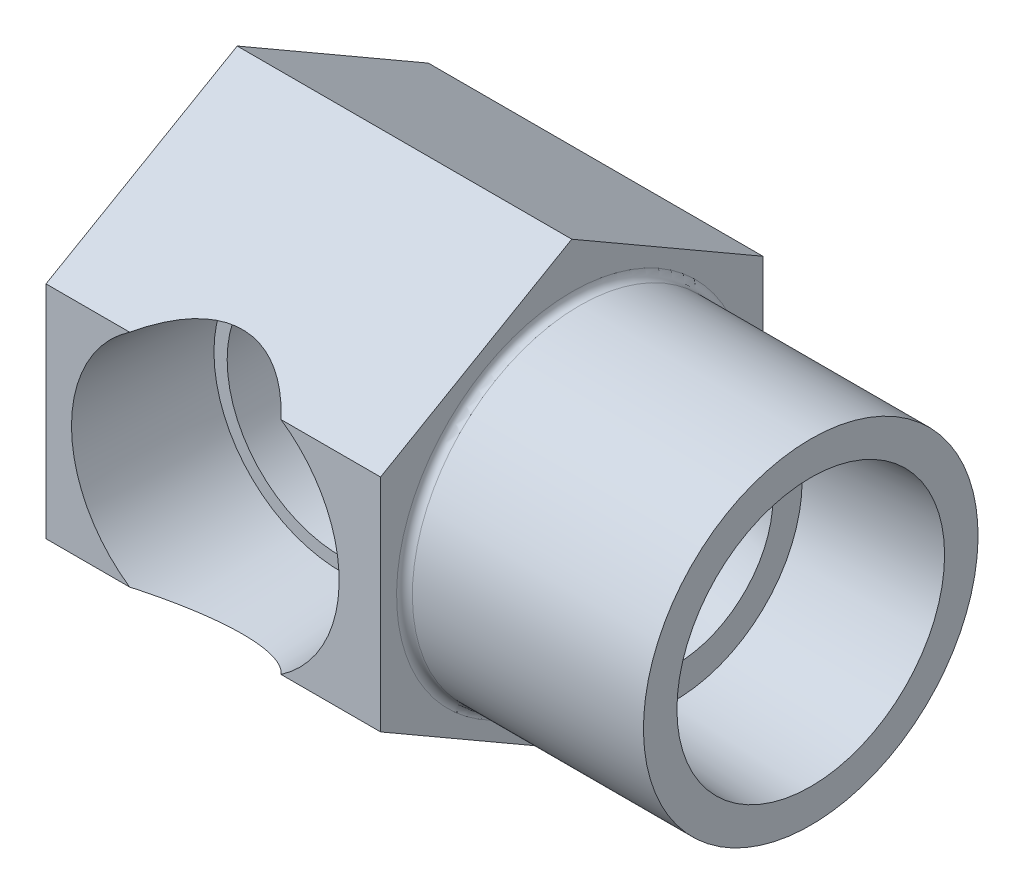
ISO-10303-21;
HEADER;
FILE_DESCRIPTION(('STEP AP214'),'2;1');
FILE_NAME('part.step','',(''),(''),'','','');
FILE_SCHEMA(('AUTOMOTIVE_DESIGN { 1 0 10303 214 1 1 1 1 }'));
ENDSEC;
DATA;
#1=APPLICATION_CONTEXT('core data for automotive mechanical design processes');
#2=APPLICATION_PROTOCOL_DEFINITION('international standard','automotive_design',2000,#1);
#3=PRODUCT_CONTEXT('',#1,'mechanical');
#4=PRODUCT('Part','Part','',(#3));
#5=PRODUCT_RELATED_PRODUCT_CATEGORY('part','',(#4));
#6=PRODUCT_DEFINITION_FORMATION('','',#4);
#7=PRODUCT_DEFINITION_CONTEXT('part definition',#1,'design');
#8=PRODUCT_DEFINITION('design','',#6,#7);
#9=PRODUCT_DEFINITION_SHAPE('','',#8);
#10=(LENGTH_UNIT() NAMED_UNIT(*) SI_UNIT(.MILLI.,.METRE.));
#11=(NAMED_UNIT(*) PLANE_ANGLE_UNIT() SI_UNIT($,.RADIAN.));
#12=(NAMED_UNIT(*) SI_UNIT($,.STERADIAN.) SOLID_ANGLE_UNIT());
#13=UNCERTAINTY_MEASURE_WITH_UNIT(LENGTH_MEASURE(1.E-05),#10,'distance_accuracy_value','');
#14=(GEOMETRIC_REPRESENTATION_CONTEXT(3) GLOBAL_UNCERTAINTY_ASSIGNED_CONTEXT((#13)) GLOBAL_UNIT_ASSIGNED_CONTEXT((#10,
#11,#12)) REPRESENTATION_CONTEXT('',''));
#15=CARTESIAN_POINT('',(0.,0.,0.));
#16=DIRECTION('',(0.,0.,1.));
#17=DIRECTION('',(1.,0.,0.));
#18=AXIS2_PLACEMENT_3D('',#15,#16,#17);
#19=CARTESIAN_POINT('',(0.,0.,5.51642065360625E-13));
#20=DIRECTION('',(-1.,0.,0.));
#21=DIRECTION('',(0.,0.,1.));
#22=AXIS2_PLACEMENT_3D('',#19,#20,#21);
#23=PLANE('',#22);
#24=CARTESIAN_POINT('',(0.,0.,5.51642065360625E-13));
#25=DIRECTION('',(-1.,0.,0.));
#26=DIRECTION('',(0.,1.,0.));
#27=AXIS2_PLACEMENT_3D('',#24,#25,#26);
#28=CIRCLE('',#27,16.66875);
#29=CARTESIAN_POINT('',(0.,16.66875,5.51642065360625E-13));
#30=VERTEX_POINT('',#29);
#31=EDGE_CURVE('E282',#30,#30,#28,.T.);
#32=ORIENTED_EDGE('',*,*,#31,.F.);
#33=EDGE_LOOP('',(#32));
#34=FACE_BOUND('',#33,.T.);
#35=CARTESIAN_POINT('',(0.,0.,5.51642065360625E-13));
#36=DIRECTION('',(-1.,0.,0.));
#37=DIRECTION('',(0.,0.,1.));
#38=AXIS2_PLACEMENT_3D('',#35,#36,#37);
#39=CIRCLE('',#38,13.335);
#40=CARTESIAN_POINT('',(0.,0.,13.3350000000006));
#41=VERTEX_POINT('',#40);
#42=EDGE_CURVE('E324',#41,#41,#39,.T.);
#43=ORIENTED_EDGE('',*,*,#42,.T.);
#44=EDGE_LOOP('',(#43));
#45=FACE_BOUND('',#44,.T.);
#46=ADVANCED_FACE('F15',(#34,#45),#23,.F.);
#47=CARTESIAN_POINT('',(-23.8125,10.9985226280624,19.05));
#48=DIRECTION('',(0.,0.,-1.));
#49=DIRECTION('',(0.,1.,0.));
#50=AXIS2_PLACEMENT_3D('',#47,#48,#49);
#51=PLANE('',#50);
#52=CARTESIAN_POINT('',(-41.275,0.,19.05));
#53=DIRECTION('',(0.,0.,-1.));
#54=DIRECTION('',(-1.,0.,0.));
#55=AXIS2_PLACEMENT_3D('',#52,#53,#54);
#56=CIRCLE('',#55,13.335);
#57=CARTESIAN_POINT('',(-33.734792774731,10.9985226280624,19.05));
#58=VERTEX_POINT('',#57);
#59=CARTESIAN_POINT('',(-33.7347927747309,-10.9985226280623,19.05));
#60=VERTEX_POINT('',#59);
#61=EDGE_CURVE('E334',#58,#60,#56,.T.);
#62=ORIENTED_EDGE('',*,*,#61,.T.);
#63=DIRECTION('',(-1.,0.,0.));
#64=VECTOR('',#63,1.);
#65=CARTESIAN_POINT('',(-23.8125,-10.9985226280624,19.05));
#66=LINE('',#65,#64);
#67=CARTESIAN_POINT('',(-23.8125,-10.9985226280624,19.05));
#68=VERTEX_POINT('',#67);
#69=EDGE_CURVE('E298',#68,#60,#66,.T.);
#70=ORIENTED_EDGE('',*,*,#69,.F.);
#71=DIRECTION('',(0.,-1.,0.));
#72=VECTOR('',#71,1.);
#73=CARTESIAN_POINT('',(-23.8125,10.9985226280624,19.05));
#74=LINE('',#73,#72);
#75=CARTESIAN_POINT('',(-23.8125,10.9985226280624,19.05));
#76=VERTEX_POINT('',#75);
#77=EDGE_CURVE('E288',#76,#68,#74,.T.);
#78=ORIENTED_EDGE('',*,*,#77,.F.);
#79=DIRECTION('',(-1.,0.,0.));
#80=VECTOR('',#79,1.);
#81=CARTESIAN_POINT('',(-23.8125,10.9985226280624,19.05));
#82=LINE('',#81,#80);
#83=EDGE_CURVE('E302',#76,#58,#82,.T.);
#84=ORIENTED_EDGE('',*,*,#83,.T.);
#85=EDGE_LOOP('',(#62,#70,#78,#84));
#86=FACE_BOUND('',#85,.T.);
#87=ADVANCED_FACE('F192',(#86),#51,.F.);
#88=CARTESIAN_POINT('',(-23.8125,-21.9970452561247,0.));
#89=DIRECTION('',(0.,0.866025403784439,0.5));
#90=DIRECTION('',(0.,-0.5,0.866025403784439));
#91=AXIS2_PLACEMENT_3D('',#88,#89,#90);
#92=PLANE('',#91);
#93=DIRECTION('',(0.,0.5,-0.866025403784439));
#94=VECTOR('',#93,1.);
#95=CARTESIAN_POINT('',(-57.15,-21.9970452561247,0.));
#96=LINE('',#95,#94);
#97=CARTESIAN_POINT('',(-57.15,-21.9970452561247,0.));
#98=VERTEX_POINT('',#97);
#99=CARTESIAN_POINT('',(-57.15,-10.9985226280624,-19.05));
#100=VERTEX_POINT('',#99);
#101=EDGE_CURVE('E253',#98,#100,#96,.T.);
#102=ORIENTED_EDGE('',*,*,#101,.T.);
#103=DIRECTION('',(-1.,0.,0.));
#104=VECTOR('',#103,1.);
#105=CARTESIAN_POINT('',(-23.8125,-10.9985226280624,-19.05));
#106=LINE('',#105,#104);
#107=CARTESIAN_POINT('',(-23.8125,-10.9985226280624,-19.05));
#108=VERTEX_POINT('',#107);
#109=EDGE_CURVE('E247',#108,#100,#106,.T.);
#110=ORIENTED_EDGE('',*,*,#109,.F.);
#111=DIRECTION('',(0.,0.5,-0.866025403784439));
#112=VECTOR('',#111,1.);
#113=CARTESIAN_POINT('',(-23.8125,-21.9970452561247,0.));
#114=LINE('',#113,#112);
#115=CARTESIAN_POINT('',(-23.8125,-21.9970452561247,0.));
#116=VERTEX_POINT('',#115);
#117=EDGE_CURVE('E279',#116,#108,#114,.T.);
#118=ORIENTED_EDGE('',*,*,#117,.F.);
#119=DIRECTION('',(-1.,0.,0.));
#120=VECTOR('',#119,1.);
#121=CARTESIAN_POINT('',(-23.8125,-21.9970452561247,0.));
#122=LINE('',#121,#120);
#123=EDGE_CURVE('E292',#116,#98,#122,.T.);
#124=ORIENTED_EDGE('',*,*,#123,.T.);
#125=EDGE_LOOP('',(#102,#110,#118,#124));
#126=FACE_BOUND('',#125,.T.);
#127=ADVANCED_FACE('F17',(#126),#92,.F.);
#128=CARTESIAN_POINT('',(-23.8125,-10.9985226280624,-19.05));
#129=DIRECTION('',(0.,0.,1.));
#130=DIRECTION('',(1.,0.,0.));
#131=AXIS2_PLACEMENT_3D('',#128,#129,#130);
#132=PLANE('',#131);
#133=DIRECTION('',(0.,1.,0.));
#134=VECTOR('',#133,1.);
#135=CARTESIAN_POINT('',(-57.15,-10.9985226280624,-19.05));
#136=LINE('',#135,#134);
#137=CARTESIAN_POINT('',(-57.15,10.9985226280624,-19.05));
#138=VERTEX_POINT('',#137);
#139=EDGE_CURVE('E242',#100,#138,#136,.T.);
#140=ORIENTED_EDGE('',*,*,#139,.T.);
#141=DIRECTION('',(-1.,0.,0.));
#142=VECTOR('',#141,1.);
#143=CARTESIAN_POINT('',(-23.8125,10.9985226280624,-19.05));
#144=LINE('',#143,#142);
#145=CARTESIAN_POINT('',(-23.8125,10.9985226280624,-19.05));
#146=VERTEX_POINT('',#145);
#147=EDGE_CURVE('E244',#146,#138,#144,.T.);
#148=ORIENTED_EDGE('',*,*,#147,.F.);
#149=DIRECTION('',(0.,1.,0.));
#150=VECTOR('',#149,1.);
#151=CARTESIAN_POINT('',(-23.8125,-10.9985226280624,-19.05));
#152=LINE('',#151,#150);
#153=EDGE_CURVE('E283',#108,#146,#152,.T.);
#154=ORIENTED_EDGE('',*,*,#153,.F.);
#155=ORIENTED_EDGE('',*,*,#109,.T.);
#156=EDGE_LOOP('',(#140,#148,#154,#155));
#157=FACE_BOUND('',#156,.T.);
#158=ADVANCED_FACE('F231',(#157),#132,.F.);
#159=CARTESIAN_POINT('',(-23.8125,10.9985226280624,-19.05));
#160=DIRECTION('',(0.,-0.866025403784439,0.5));
#161=DIRECTION('',(0.,-0.5,-0.866025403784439));
#162=AXIS2_PLACEMENT_3D('',#159,#160,#161);
#163=PLANE('',#162);
#164=DIRECTION('',(0.,0.5,0.866025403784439));
#165=VECTOR('',#164,1.);
#166=CARTESIAN_POINT('',(-57.15,10.9985226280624,-19.05));
#167=LINE('',#166,#165);
#168=CARTESIAN_POINT('',(-57.15,21.9970452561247,0.));
#169=VERTEX_POINT('',#168);
#170=EDGE_CURVE('E252',#138,#169,#167,.T.);
#171=ORIENTED_EDGE('',*,*,#170,.T.);
#172=DIRECTION('',(-1.,0.,0.));
#173=VECTOR('',#172,1.);
#174=CARTESIAN_POINT('',(-23.8125,21.9970452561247,0.));
#175=LINE('',#174,#173);
#176=CARTESIAN_POINT('',(-23.8125,21.9970452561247,0.));
#177=VERTEX_POINT('',#176);
#178=EDGE_CURVE('E258',#177,#169,#175,.T.);
#179=ORIENTED_EDGE('',*,*,#178,.F.);
#180=DIRECTION('',(0.,0.5,0.866025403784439));
#181=VECTOR('',#180,1.);
#182=CARTESIAN_POINT('',(-23.8125,10.9985226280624,-19.05));
#183=LINE('',#182,#181);
#184=EDGE_CURVE('E257',#146,#177,#183,.T.);
#185=ORIENTED_EDGE('',*,*,#184,.F.);
#186=ORIENTED_EDGE('',*,*,#147,.T.);
#187=EDGE_LOOP('',(#171,#179,#185,#186));
#188=FACE_BOUND('',#187,.T.);
#189=ADVANCED_FACE('F228',(#188),#163,.F.);
#190=CARTESIAN_POINT('',(-23.8125,21.9970452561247,0.));
#191=DIRECTION('',(0.,-0.866025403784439,-0.5));
#192=DIRECTION('',(0.,0.5,-0.866025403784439));
#193=AXIS2_PLACEMENT_3D('',#190,#191,#192);
#194=PLANE('',#193);
#195=CARTESIAN_POINT('',(-48.815207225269,10.9985226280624,19.05));
#196=VERTEX_POINT('',#195);
#197=CARTESIAN_POINT('',(-57.15,10.9985226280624,19.05));
#198=VERTEX_POINT('',#197);
#199=EDGE_CURVE('E301',#196,#198,#82,.T.);
#200=ORIENTED_EDGE('',*,*,#199,.F.);
#201=CARTESIAN_POINT('',(-41.275,-1.31189154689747,40.3722628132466));
#202=DIRECTION('',(0.,-0.866025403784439,-0.5));
#203=DIRECTION('',(0.,-0.5,0.866025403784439));
#204=AXIS2_PLACEMENT_3D('',#201,#202,#203);
#205=ELLIPSE('',#204,28.9049048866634,14.3927871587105);
#206=EDGE_CURVE('E336',#196,#58,#205,.T.);
#207=ORIENTED_EDGE('',*,*,#206,.T.);
#208=ORIENTED_EDGE('',*,*,#83,.F.);
#209=DIRECTION('',(0.,-0.5,0.866025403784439));
#210=VECTOR('',#209,1.);
#211=CARTESIAN_POINT('',(-23.8125,21.9970452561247,0.));
#212=LINE('',#211,#210);
#213=EDGE_CURVE('E286',#177,#76,#212,.T.);
#214=ORIENTED_EDGE('',*,*,#213,.F.);
#215=ORIENTED_EDGE('',*,*,#178,.T.);
#216=DIRECTION('',(0.,-0.5,0.866025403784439));
#217=VECTOR('',#216,1.);
#218=CARTESIAN_POINT('',(-57.15,21.9970452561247,0.));
#219=LINE('',#218,#217);
#220=EDGE_CURVE('E263',#169,#198,#219,.T.);
#221=ORIENTED_EDGE('',*,*,#220,.T.);
#222=EDGE_LOOP('',(#200,#207,#208,#214,#215,#221));
#223=FACE_BOUND('',#222,.T.);
#224=ADVANCED_FACE('F224',(#223),#194,.F.);
#225=CARTESIAN_POINT('',(-48.8152072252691,-10.9985226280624,19.05));
#226=VERTEX_POINT('',#225);
#227=CARTESIAN_POINT('',(-57.15,-10.9985226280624,19.05));
#228=VERTEX_POINT('',#227);
#229=EDGE_CURVE('E297',#226,#228,#66,.T.);
#230=ORIENTED_EDGE('',*,*,#229,.F.);
#231=EDGE_CURVE('E43',#226,#196,#56,.T.);
#232=ORIENTED_EDGE('',*,*,#231,.T.);
#233=ORIENTED_EDGE('',*,*,#199,.T.);
#234=DIRECTION('',(0.,-1.,0.));
#235=VECTOR('',#234,1.);
#236=CARTESIAN_POINT('',(-57.15,10.9985226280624,19.05));
#237=LINE('',#236,#235);
#238=EDGE_CURVE('E269',#198,#228,#237,.T.);
#239=ORIENTED_EDGE('',*,*,#238,.T.);
#240=EDGE_LOOP('',(#230,#232,#233,#239));
#241=FACE_BOUND('',#240,.T.);
#242=ADVANCED_FACE('F201',(#241),#51,.F.);
#243=CARTESIAN_POINT('',(-23.8125,-10.9985226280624,19.05));
#244=DIRECTION('',(0.,0.866025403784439,-0.5));
#245=DIRECTION('',(0.,0.5,0.866025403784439));
#246=AXIS2_PLACEMENT_3D('',#243,#244,#245);
#247=PLANE('',#246);
#248=ORIENTED_EDGE('',*,*,#69,.T.);
#249=CARTESIAN_POINT('',(-41.275,1.31189154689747,40.3722628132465));
#250=DIRECTION('',(0.,0.866025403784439,-0.5));
#251=DIRECTION('',(0.,0.5,0.866025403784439));
#252=AXIS2_PLACEMENT_3D('',#249,#250,#251);
#253=ELLIPSE('',#252,28.9049048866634,14.3927871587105);
#254=EDGE_CURVE('E313',#60,#226,#253,.T.);
#255=ORIENTED_EDGE('',*,*,#254,.T.);
#256=ORIENTED_EDGE('',*,*,#229,.T.);
#257=DIRECTION('',(0.,-0.5,-0.866025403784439));
#258=VECTOR('',#257,1.);
#259=CARTESIAN_POINT('',(-57.15,-10.9985226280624,19.05));
#260=LINE('',#259,#258);
#261=EDGE_CURVE('E276',#228,#98,#260,.T.);
#262=ORIENTED_EDGE('',*,*,#261,.T.);
#263=ORIENTED_EDGE('',*,*,#123,.F.);
#264=DIRECTION('',(0.,-0.5,-0.866025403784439));
#265=VECTOR('',#264,1.);
#266=CARTESIAN_POINT('',(-23.8125,-10.9985226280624,19.05));
#267=LINE('',#266,#265);
#268=EDGE_CURVE('E290',#68,#116,#267,.T.);
#269=ORIENTED_EDGE('',*,*,#268,.F.);
#270=EDGE_LOOP('',(#248,#255,#256,#262,#263,#269));
#271=FACE_BOUND('',#270,.T.);
#272=ADVANCED_FACE('F218',(#271),#247,.F.);
#273=CARTESIAN_POINT('',(-23.8125,-10.9985226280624,-19.05));
#274=DIRECTION('',(1.,0.,0.));
#275=DIRECTION('',(0.,1.,0.));
#276=AXIS2_PLACEMENT_3D('',#273,#274,#275);
#277=PLANE('',#276);
#278=CARTESIAN_POINT('',(-23.8125,0.,5.51642065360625E-13));
#279=DIRECTION('',(1.,0.,0.));
#280=DIRECTION('',(0.,1.,0.));
#281=AXIS2_PLACEMENT_3D('',#278,#279,#280);
#282=CIRCLE('',#281,17.45615);
#283=CARTESIAN_POINT('',(-23.8125,17.45615,5.51642065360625E-13));
#284=VERTEX_POINT('',#283);
#285=EDGE_CURVE('E310',#284,#284,#282,.F.);
#286=ORIENTED_EDGE('',*,*,#285,.T.);
#287=EDGE_LOOP('',(#286));
#288=FACE_BOUND('',#287,.T.);
#289=ORIENTED_EDGE('',*,*,#117,.T.);
#290=ORIENTED_EDGE('',*,*,#153,.T.);
#291=ORIENTED_EDGE('',*,*,#184,.T.);
#292=ORIENTED_EDGE('',*,*,#213,.T.);
#293=ORIENTED_EDGE('',*,*,#77,.T.);
#294=ORIENTED_EDGE('',*,*,#268,.T.);
#295=EDGE_LOOP('',(#289,#290,#291,#292,#293,#294));
#296=FACE_BOUND('',#295,.T.);
#297=ADVANCED_FACE('F214',(#288,#296),#277,.T.);
#298=CARTESIAN_POINT('',(-57.15,-10.9985226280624,-19.05));
#299=DIRECTION('',(1.,0.,0.));
#300=DIRECTION('',(0.,1.,0.));
#301=AXIS2_PLACEMENT_3D('',#298,#299,#300);
#302=PLANE('',#301);
#303=ORIENTED_EDGE('',*,*,#101,.F.);
#304=ORIENTED_EDGE('',*,*,#261,.F.);
#305=ORIENTED_EDGE('',*,*,#238,.F.);
#306=ORIENTED_EDGE('',*,*,#220,.F.);
#307=ORIENTED_EDGE('',*,*,#170,.F.);
#308=ORIENTED_EDGE('',*,*,#139,.F.);
#309=EDGE_LOOP('',(#303,#304,#305,#306,#307,#308));
#310=FACE_BOUND('',#309,.T.);
#311=ADVANCED_FACE('F210',(#310),#302,.F.);
#312=CARTESIAN_POINT('',(0.,0.,5.51642065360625E-13));
#313=DIRECTION('',(-1.,0.,0.));
#314=DIRECTION('',(0.,0.,1.));
#315=AXIS2_PLACEMENT_3D('',#312,#313,#314);
#316=CYLINDRICAL_SURFACE('',#315,16.66875);
#317=CARTESIAN_POINT('',(-23.0251,0.,5.51642065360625E-13));
#318=DIRECTION('',(1.,0.,0.));
#319=DIRECTION('',(0.,1.,0.));
#320=AXIS2_PLACEMENT_3D('',#317,#318,#319);
#321=CIRCLE('',#320,16.66875);
#322=CARTESIAN_POINT('',(-23.0251,16.66875,5.51642065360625E-13));
#323=VERTEX_POINT('',#322);
#324=EDGE_CURVE('E307',#323,#323,#321,.T.);
#325=ORIENTED_EDGE('',*,*,#324,.T.);
#326=EDGE_LOOP('',(#325));
#327=FACE_BOUND('',#326,.T.);
#328=ORIENTED_EDGE('',*,*,#31,.T.);
#329=EDGE_LOOP('',(#328));
#330=FACE_BOUND('',#329,.T.);
#331=ADVANCED_FACE('F207',(#327,#330),#316,.T.);
#332=CARTESIAN_POINT('',(-23.0251,0.,5.51642065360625E-13));
#333=DIRECTION('',(1.,0.,0.));
#334=DIRECTION('',(0.,1.,0.));
#335=AXIS2_PLACEMENT_3D('',#332,#333,#334);
#336=TOROIDAL_SURFACE('',#335,17.45615,0.7874);
#337=ORIENTED_EDGE('',*,*,#285,.F.);
#338=EDGE_LOOP('',(#337));
#339=FACE_BOUND('',#338,.T.);
#340=ORIENTED_EDGE('',*,*,#324,.F.);
#341=EDGE_LOOP('',(#340));
#342=FACE_BOUND('',#341,.T.);
#343=ADVANCED_FACE('F206',(#339,#342),#336,.F.);
#344=CARTESIAN_POINT('',(-41.275,0.,5.5626));
#345=DIRECTION('',(0.,0.,1.));
#346=DIRECTION('',(1.,0.,0.));
#347=AXIS2_PLACEMENT_3D('',#344,#345,#346);
#348=CONICAL_SURFACE('',#347,12.6281553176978,0.0523598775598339);
#349=ORIENTED_EDGE('',*,*,#254,.F.);
#350=ORIENTED_EDGE('',*,*,#61,.F.);
#351=ORIENTED_EDGE('',*,*,#206,.F.);
#352=ORIENTED_EDGE('',*,*,#231,.F.);
#353=EDGE_LOOP('',(#349,#350,#351,#352));
#354=FACE_BOUND('',#353,.T.);
#355=CARTESIAN_POINT('',(-41.275,0.,5.5626));
#356=DIRECTION('',(0.,0.,-1.));
#357=DIRECTION('',(-1.,0.,0.));
#358=AXIS2_PLACEMENT_3D('',#355,#356,#357);
#359=CIRCLE('',#358,12.6281553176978);
#360=CARTESIAN_POINT('',(-29.8180676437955,-5.31121527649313,5.5626));
#361=VERTEX_POINT('',#360);
#362=CARTESIAN_POINT('',(-29.8180676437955,5.31121527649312,5.5626));
#363=VERTEX_POINT('',#362);
#364=EDGE_CURVE('E323',#361,#363,#359,.T.);
#365=ORIENTED_EDGE('',*,*,#364,.T.);
#366=CARTESIAN_POINT('',(-29.8182058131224,5.31148839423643,5.5624));
#367=CARTESIAN_POINT('',(-29.7305378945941,5.13821159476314,5.68929346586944));
#368=CARTESIAN_POINT('',(-29.6457157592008,4.95980580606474,5.81130883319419));
#369=CARTESIAN_POINT('',(-29.4828249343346,4.59278409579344,6.04447340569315));
#370=CARTESIAN_POINT('',(-29.4047638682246,4.40415702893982,6.15561036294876));
#371=CARTESIAN_POINT('',(-29.2560137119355,4.01544544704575,6.36653280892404));
#372=CARTESIAN_POINT('',(-29.1853945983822,3.815275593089,6.46621123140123));
#373=CARTESIAN_POINT('',(-29.0535892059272,3.40564401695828,6.65164048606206));
#374=CARTESIAN_POINT('',(-28.9923999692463,3.19618523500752,6.73739568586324));
#375=CARTESIAN_POINT('',(-28.8802782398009,2.76729953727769,6.89412911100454));
#376=CARTESIAN_POINT('',(-28.8294225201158,2.5478118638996,6.96499685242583));
#377=CARTESIAN_POINT('',(-28.739727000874,2.10161531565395,7.08975358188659));
#378=CARTESIAN_POINT('',(-28.7008881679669,1.87490586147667,7.14364120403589));
#379=CARTESIAN_POINT('',(-28.6364007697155,1.41703547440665,7.23300779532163));
#380=CARTESIAN_POINT('',(-28.6106971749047,1.18589739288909,7.26856357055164));
#381=CARTESIAN_POINT('',(-28.572976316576,0.720397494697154,7.32071441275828));
#382=CARTESIAN_POINT('',(-28.5609567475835,0.486036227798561,7.33731267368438));
#383=CARTESIAN_POINT('',(-28.5515645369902,0.0451331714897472,7.35028343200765));
#384=CARTESIAN_POINT('',(-28.5525834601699,-0.161313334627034,7.34887698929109));
#385=CARTESIAN_POINT('',(-28.5654098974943,-0.573216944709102,7.3311615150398));
#386=CARTESIAN_POINT('',(-28.5772165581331,-0.778674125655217,7.3148536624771));
#387=CARTESIAN_POINT('',(-28.6113629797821,-1.18722198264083,7.26764125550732));
#388=CARTESIAN_POINT('',(-28.6337135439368,-1.39031001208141,7.23672173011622));
#389=CARTESIAN_POINT('',(-28.6884550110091,-1.79246165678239,7.16087865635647));
#390=CARTESIAN_POINT('',(-28.7208459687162,-1.99152525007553,7.11595503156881));
#391=CARTESIAN_POINT('',(-28.7935819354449,-2.37687164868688,7.0148737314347));
#392=CARTESIAN_POINT('',(-28.8335745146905,-2.56335188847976,6.95921260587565));
#393=CARTESIAN_POINT('',(-28.9215345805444,-2.93061912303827,6.83649696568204));
#394=CARTESIAN_POINT('',(-28.9695051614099,-3.1114038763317,6.76943803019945));
#395=CARTESIAN_POINT('',(-29.124263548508,-3.6440648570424,6.55247683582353));
#396=CARTESIAN_POINT('',(-29.2419525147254,-3.9865276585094,6.38671489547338));
#397=CARTESIAN_POINT('',(-29.4397249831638,-4.48908250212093,6.10583790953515));
#398=CARTESIAN_POINT('',(-29.5117257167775,-4.65969641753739,6.00318971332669));
#399=CARTESIAN_POINT('',(-29.6611034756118,-4.99206370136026,5.78916867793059));
#400=CARTESIAN_POINT('',(-29.7384630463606,-5.15384302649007,5.67782402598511));
#401=CARTESIAN_POINT('',(-29.8182058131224,-5.31148839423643,5.5624));
#402=B_SPLINE_CURVE_WITH_KNOTS('',3,(#366,#367,#368,#369,#370,#371,#372,#373,#374,#375,#376,
#377,#378,#379,#380,#381,#382,#383,#384,#385,#386,#387,#388,#389,#390,#391,#392,#393,#394,#395,
#396,#397,#398,#399,#400,#401),.UNSPECIFIED.,.F.,.F.,(4,2,2,2,2,2,2,2,2,2,2,2,2,2,2,2,2,4),(0.,
0.695930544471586,1.39263583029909,2.09539702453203,2.79793733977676,3.50552033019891,
4.21316022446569,4.91781067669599,5.62234239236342,6.24089661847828,6.85940190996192,
7.47854229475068,8.09768605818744,8.69310026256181,9.28874593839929,10.4791609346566,
11.1140169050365,11.7468943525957),.UNSPECIFIED.);
#403=EDGE_CURVE('E131',#363,#361,#402,.T.);
#404=ORIENTED_EDGE('',*,*,#403,.T.);
#405=EDGE_LOOP('',(#365,#404));
#406=FACE_BOUND('',#405,.T.);
#407=ADVANCED_FACE('F351',(#354,#406),#348,.F.);
#408=CARTESIAN_POINT('',(-41.275,0.,-11.0607852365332));
#409=DIRECTION('',(0.,0.,1.));
#410=DIRECTION('',(1.,0.,0.));
#411=AXIS2_PLACEMENT_3D('',#408,#409,#410);
#412=CONICAL_SURFACE('',#411,0.,1.04719755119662);
#413=CARTESIAN_POINT('',(-41.275,0.,-4.53044908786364));
#414=DIRECTION('',(0.,0.,-1.));
#415=DIRECTION('',(-1.,0.,0.));
#416=AXIS2_PLACEMENT_3D('',#413,#414,#415);
#417=CIRCLE('',#416,11.310874);
#418=CARTESIAN_POINT('',(-35.7325391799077,-9.85986808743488,-4.53044908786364));
#419=VERTEX_POINT('',#418);
#420=CARTESIAN_POINT('',(-35.7325391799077,9.85986808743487,-4.53044908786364));
#421=VERTEX_POINT('',#420);
#422=EDGE_CURVE('E130',#419,#421,#417,.T.);
#423=ORIENTED_EDGE('',*,*,#422,.F.);
#424=CARTESIAN_POINT('',(-35.7318247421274,-9.85986385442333,-4.53024908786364));
#425=CARTESIAN_POINT('',(-36.0509366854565,-9.86173387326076,-4.61958553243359));
#426=CARTESIAN_POINT('',(-36.3717124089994,-9.86390668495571,-4.70330076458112));
#427=CARTESIAN_POINT('',(-37.0157137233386,-9.86925092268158,-4.85708254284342));
#428=CARTESIAN_POINT('',(-37.338931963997,-9.87242003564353,-4.92718010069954));
#429=CARTESIAN_POINT('',(-37.9885492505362,-9.88015648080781,-5.05177867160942));
#430=CARTESIAN_POINT('',(-38.3149495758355,-9.88472439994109,-5.10627311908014));
#431=CARTESIAN_POINT('',(-38.806727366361,-9.89271020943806,-5.17485095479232));
#432=CARTESIAN_POINT('',(-38.971211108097,-9.8955651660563,-5.1955328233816));
#433=CARTESIAN_POINT('',(-39.3006993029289,-9.9016266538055,-5.23229495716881));
#434=CARTESIAN_POINT('',(-39.4657038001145,-9.90483321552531,-5.24837482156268));
#435=CARTESIAN_POINT('',(-39.6309149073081,-9.9082022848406,-5.2620644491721));
#436=B_SPLINE_CURVE_WITH_KNOTS('',3,(#424,#425,#426,#427,#428,#429,#430,#431,#432,#433,#434,
#435),.UNSPECIFIED.,.F.,.F.,(4,2,2,2,2,4),(0.,0.994235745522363,1.98618005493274,
2.97854115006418,3.47589411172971,3.9732903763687),.UNSPECIFIED.);
#437=CARTESIAN_POINT('',(-37.8107767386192,-9.87808537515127,-5.01712703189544));
#438=VERTEX_POINT('',#437);
#439=EDGE_CURVE('E122',#419,#438,#436,.T.);
#440=ORIENTED_EDGE('',*,*,#439,.T.);
#441=CARTESIAN_POINT('',(-44.0118236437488,0.,-9.48067936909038));
#442=CARTESIAN_POINT('',(-44.0118239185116,-0.0348789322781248,-9.48067956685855));
#443=CARTESIAN_POINT('',(-44.0115269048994,-0.0697578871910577,-9.48046577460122));
#444=CARTESIAN_POINT('',(-44.0102131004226,-0.146963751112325,-9.47952008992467));
#445=CARTESIAN_POINT('',(-44.0090558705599,-0.189287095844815,-9.47868710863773));
#446=CARTESIAN_POINT('',(-44.0058188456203,-0.275269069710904,-9.47635707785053));
#447=CARTESIAN_POINT('',(-44.0037100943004,-0.318926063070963,-9.47483918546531));
#448=CARTESIAN_POINT('',(-43.9998070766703,-0.385188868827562,-9.4720297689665));
#449=CARTESIAN_POINT('',(-43.9983489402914,-0.407825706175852,-9.47098019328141));
#450=CARTESIAN_POINT('',(-43.9936029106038,-0.475712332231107,-9.46756397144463));
#451=CARTESIAN_POINT('',(-43.9899440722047,-0.520924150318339,-9.4649303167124));
#452=CARTESIAN_POINT('',(-43.9816517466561,-0.611218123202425,-9.45896144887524));
#453=CARTESIAN_POINT('',(-43.977018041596,-0.656300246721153,-9.45562607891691));
#454=CARTESIAN_POINT('',(-43.9513258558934,-0.882330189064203,-9.43713268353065));
#455=CARTESIAN_POINT('',(-43.9229530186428,-1.06210426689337,-9.41670974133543));
#456=CARTESIAN_POINT('',(-43.8521480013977,-1.41729567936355,-9.36574384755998));
#457=CARTESIAN_POINT('',(-43.8097136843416,-1.59271234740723,-9.33519935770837));
#458=CARTESIAN_POINT('',(-43.6992708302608,-1.98604730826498,-9.25570189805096));
#459=CARTESIAN_POINT('',(-43.6274361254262,-2.20232946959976,-9.20399482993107));
#460=CARTESIAN_POINT('',(-43.467836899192,-2.6259043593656,-9.08911430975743));
#461=CARTESIAN_POINT('',(-43.3800549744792,-2.83318695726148,-9.02592833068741));
#462=CARTESIAN_POINT('',(-43.2384371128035,-3.13876850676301,-8.92399090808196));
#463=CARTESIAN_POINT('',(-43.189219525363,-3.24038317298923,-8.88856378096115));
#464=CARTESIAN_POINT('',(-43.0879473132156,-3.44144938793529,-8.81566740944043));
#465=CARTESIAN_POINT('',(-43.0358926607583,-3.54090091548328,-8.77819814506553));
#466=CARTESIAN_POINT('',(-42.9293169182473,-3.73767848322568,-8.70148425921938));
#467=CARTESIAN_POINT('',(-42.8747974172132,-3.83500583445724,-8.66224078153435));
#468=CARTESIAN_POINT('',(-42.7635488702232,-4.02771448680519,-8.58216338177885));
#469=CARTESIAN_POINT('',(-42.7068198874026,-4.12309584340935,-8.54132950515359));
#470=CARTESIAN_POINT('',(-42.5278083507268,-4.41615514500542,-8.41247588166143));
#471=CARTESIAN_POINT('',(-42.4021757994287,-4.61073581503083,-8.32204478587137));
#472=CARTESIAN_POINT('',(-42.1441247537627,-4.99297318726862,-8.13629802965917));
#473=CARTESIAN_POINT('',(-42.0117042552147,-5.18062781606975,-8.04098092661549));
#474=CARTESIAN_POINT('',(-41.7413336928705,-5.55013685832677,-7.84636650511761));
#475=CARTESIAN_POINT('',(-41.6033777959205,-5.73198477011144,-7.74706498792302));
#476=CARTESIAN_POINT('',(-41.3231302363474,-6.09048124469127,-7.54534104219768));
#477=CARTESIAN_POINT('',(-41.1808389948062,-6.26713030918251,-7.44291891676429));
#478=CARTESIAN_POINT('',(-40.891870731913,-6.61695729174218,-7.23491775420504));
#479=CARTESIAN_POINT('',(-40.745173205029,-6.79010942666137,-7.12932395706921));
#480=CARTESIAN_POINT('',(-40.4487972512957,-7.13249479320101,-6.91599069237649));
#481=CARTESIAN_POINT('',(-40.299118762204,-7.30172794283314,-6.80825118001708));
#482=CARTESIAN_POINT('',(-39.9973568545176,-7.63668027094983,-6.59104107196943));
#483=CARTESIAN_POINT('',(-39.8452748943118,-7.80240144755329,-6.48157152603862));
#484=CARTESIAN_POINT('',(-39.5389989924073,-8.13085707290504,-6.26111221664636));
#485=CARTESIAN_POINT('',(-39.3848050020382,-8.29359145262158,-6.15012241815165));
#486=CARTESIAN_POINT('',(-38.9520086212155,-8.7440539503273,-5.83859287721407));
#487=CARTESIAN_POINT('',(-38.6714229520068,-9.02889046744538,-5.63662555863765));
#488=CARTESIAN_POINT('',(-38.105789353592,-9.59183626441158,-5.22947895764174));
#489=CARTESIAN_POINT('',(-37.8207407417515,-9.86994449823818,-5.02429918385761));
#490=CARTESIAN_POINT('',(-37.2507072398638,-10.4172075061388,-4.61398550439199));
#491=CARTESIAN_POINT('',(-36.9657654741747,-10.6864305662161,-4.40888263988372));
#492=CARTESIAN_POINT('',(-36.5363304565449,-11.0868631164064,-4.09977262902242));
#493=CARTESIAN_POINT('',(-36.3928677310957,-11.2197560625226,-3.99650726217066));
#494=CARTESIAN_POINT('',(-36.1053194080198,-11.4845112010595,-3.78952818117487));
#495=CARTESIAN_POINT('',(-35.9612338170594,-11.6163734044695,-3.68581447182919));
#496=CARTESIAN_POINT('',(-35.8168670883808,-11.7477670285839,-3.5818983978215));
#497=B_SPLINE_CURVE_WITH_KNOTS('',3,(#441,#442,#443,#444,#445,#446,#447,#448,#449,#450,#451,
#452,#453,#454,#455,#456,#457,#458,#459,#460,#461,#462,#463,#464,#465,#466,#467,#468,#469,#470,
#471,#472,#473,#474,#475,#476,#477,#478,#479,#480,#481,#482,#483,#484,#485,#486,#487,#488,#489,
#490,#491,#492,#493,#494,#495,#496),.UNSPECIFIED.,.F.,.F.,(4,2,2,2,2,2,2,2,2,2,2,2,2,2,2,2,2,2,
2,2,2,2,2,2,2,2,2,4),(0.,0.104635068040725,0.231663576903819,0.362849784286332,
0.430972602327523,0.567260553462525,0.703579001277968,1.25189979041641,1.8003039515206,
2.50010843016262,3.20068124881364,3.55562661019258,3.91057544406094,4.26529862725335,
4.62001168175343,5.36560739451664,6.11142453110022,6.85804938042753,7.60460194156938,
8.35544495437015,9.10630366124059,9.85672303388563,10.6071597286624,11.9508621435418,
13.2947721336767,14.6220012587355,15.2854382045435,15.9488680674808),.UNSPECIFIED.);
#498=CARTESIAN_POINT('',(-44.0118236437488,0.,-9.48067936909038));
#499=VERTEX_POINT('',#498);
#500=EDGE_CURVE('E28',#438,#499,#497,.F.);
#501=ORIENTED_EDGE('',*,*,#500,.T.);
#502=CARTESIAN_POINT('',(-44.0118236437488,0.,-9.48067936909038));
#503=CARTESIAN_POINT('',(-44.0118239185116,0.0348789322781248,-9.48067956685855));
#504=CARTESIAN_POINT('',(-44.0115269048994,0.0697578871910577,-9.48046577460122));
#505=CARTESIAN_POINT('',(-44.0102131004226,0.146963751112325,-9.47952008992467));
#506=CARTESIAN_POINT('',(-44.0090558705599,0.189287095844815,-9.47868710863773));
#507=CARTESIAN_POINT('',(-44.0058188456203,0.275269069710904,-9.47635707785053));
#508=CARTESIAN_POINT('',(-44.0037100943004,0.318926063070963,-9.47483918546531));
#509=CARTESIAN_POINT('',(-43.9998070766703,0.385188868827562,-9.4720297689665));
#510=CARTESIAN_POINT('',(-43.9983489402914,0.407825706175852,-9.47098019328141));
#511=CARTESIAN_POINT('',(-43.9936029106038,0.475712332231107,-9.46756397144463));
#512=CARTESIAN_POINT('',(-43.9899440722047,0.520924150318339,-9.4649303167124));
#513=CARTESIAN_POINT('',(-43.9816517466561,0.611218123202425,-9.45896144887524));
#514=CARTESIAN_POINT('',(-43.977018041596,0.656300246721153,-9.45562607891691));
#515=CARTESIAN_POINT('',(-43.9513258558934,0.882330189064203,-9.43713268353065));
#516=CARTESIAN_POINT('',(-43.9229530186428,1.06210426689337,-9.41670974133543));
#517=CARTESIAN_POINT('',(-43.8521480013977,1.41729567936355,-9.36574384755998));
#518=CARTESIAN_POINT('',(-43.8097136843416,1.59271234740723,-9.33519935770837));
#519=CARTESIAN_POINT('',(-43.6992708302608,1.98604730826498,-9.25570189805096));
#520=CARTESIAN_POINT('',(-43.6274361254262,2.20232946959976,-9.20399482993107));
#521=CARTESIAN_POINT('',(-43.467836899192,2.6259043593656,-9.08911430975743));
#522=CARTESIAN_POINT('',(-43.3800549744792,2.83318695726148,-9.02592833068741));
#523=CARTESIAN_POINT('',(-43.2384371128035,3.13876850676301,-8.92399090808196));
#524=CARTESIAN_POINT('',(-43.189219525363,3.24038317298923,-8.88856378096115));
#525=CARTESIAN_POINT('',(-43.0879473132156,3.44144938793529,-8.81566740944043));
#526=CARTESIAN_POINT('',(-43.0358926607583,3.54090091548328,-8.77819814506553));
#527=CARTESIAN_POINT('',(-42.9293169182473,3.73767848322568,-8.70148425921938));
#528=CARTESIAN_POINT('',(-42.8747974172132,3.83500583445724,-8.66224078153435));
#529=CARTESIAN_POINT('',(-42.7635488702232,4.02771448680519,-8.58216338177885));
#530=CARTESIAN_POINT('',(-42.7068198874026,4.12309584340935,-8.54132950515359));
#531=CARTESIAN_POINT('',(-42.5278083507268,4.41615514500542,-8.41247588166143));
#532=CARTESIAN_POINT('',(-42.4021757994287,4.61073581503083,-8.32204478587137));
#533=CARTESIAN_POINT('',(-42.1441247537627,4.99297318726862,-8.13629802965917));
#534=CARTESIAN_POINT('',(-42.0117042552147,5.18062781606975,-8.04098092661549));
#535=CARTESIAN_POINT('',(-41.7413336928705,5.55013685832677,-7.84636650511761));
#536=CARTESIAN_POINT('',(-41.6033777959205,5.73198477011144,-7.74706498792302));
#537=CARTESIAN_POINT('',(-41.3231302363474,6.09048124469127,-7.54534104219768));
#538=CARTESIAN_POINT('',(-41.1808389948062,6.26713030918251,-7.44291891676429));
#539=CARTESIAN_POINT('',(-40.891870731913,6.61695729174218,-7.23491775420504));
#540=CARTESIAN_POINT('',(-40.745173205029,6.79010942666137,-7.12932395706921));
#541=CARTESIAN_POINT('',(-40.4487972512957,7.13249479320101,-6.91599069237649));
#542=CARTESIAN_POINT('',(-40.299118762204,7.30172794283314,-6.80825118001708));
#543=CARTESIAN_POINT('',(-39.9973568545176,7.63668027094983,-6.59104107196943));
#544=CARTESIAN_POINT('',(-39.8452748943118,7.80240144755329,-6.48157152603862));
#545=CARTESIAN_POINT('',(-39.5389989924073,8.13085707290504,-6.26111221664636));
#546=CARTESIAN_POINT('',(-39.3848050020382,8.29359145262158,-6.15012241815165));
#547=CARTESIAN_POINT('',(-38.9520086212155,8.7440539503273,-5.83859287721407));
#548=CARTESIAN_POINT('',(-38.6714229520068,9.02889046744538,-5.63662555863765));
#549=CARTESIAN_POINT('',(-38.105789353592,9.59183626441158,-5.22947895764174));
#550=CARTESIAN_POINT('',(-37.8207407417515,9.86994449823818,-5.02429918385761));
#551=CARTESIAN_POINT('',(-37.2507072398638,10.4172075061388,-4.61398550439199));
#552=CARTESIAN_POINT('',(-36.9657654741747,10.6864305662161,-4.40888263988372));
#553=CARTESIAN_POINT('',(-36.5363304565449,11.0868631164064,-4.09977262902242));
#554=CARTESIAN_POINT('',(-36.3928677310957,11.2197560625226,-3.99650726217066));
#555=CARTESIAN_POINT('',(-36.1053194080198,11.4845112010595,-3.78952818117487));
#556=CARTESIAN_POINT('',(-35.9612338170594,11.6163734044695,-3.68581447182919));
#557=CARTESIAN_POINT('',(-35.8168670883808,11.7477670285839,-3.5818983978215));
#558=B_SPLINE_CURVE_WITH_KNOTS('',3,(#502,#503,#504,#505,#506,#507,#508,#509,#510,#511,#512,
#513,#514,#515,#516,#517,#518,#519,#520,#521,#522,#523,#524,#525,#526,#527,#528,#529,#530,#531,
#532,#533,#534,#535,#536,#537,#538,#539,#540,#541,#542,#543,#544,#545,#546,#547,#548,#549,#550,
#551,#552,#553,#554,#555,#556,#557),.UNSPECIFIED.,.F.,.F.,(4,2,2,2,2,2,2,2,2,2,2,2,2,2,2,2,2,2,
2,2,2,2,2,2,2,2,2,4),(0.,0.104635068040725,0.231663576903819,0.362849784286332,
0.430972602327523,0.567260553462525,0.703579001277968,1.25189979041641,1.8003039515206,
2.50010843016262,3.20068124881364,3.55562661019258,3.91057544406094,4.26529862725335,
4.62001168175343,5.36560739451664,6.11142453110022,6.85804938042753,7.60460194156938,
8.35544495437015,9.10630366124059,9.85672303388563,10.6071597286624,11.9508621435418,
13.2947721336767,14.6220012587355,15.2854382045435,15.9488680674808),.UNSPECIFIED.);
#559=CARTESIAN_POINT('',(-37.8107767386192,9.87808537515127,-5.01712703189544));
#560=VERTEX_POINT('',#559);
#561=EDGE_CURVE('E10',#499,#560,#558,.T.);
#562=ORIENTED_EDGE('',*,*,#561,.T.);
#563=CARTESIAN_POINT('',(-39.6309149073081,9.90820228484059,-5.2620644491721));
#564=CARTESIAN_POINT('',(-39.4657038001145,9.9048332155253,-5.24837482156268));
#565=CARTESIAN_POINT('',(-39.3006993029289,9.9016266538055,-5.23229495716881));
#566=CARTESIAN_POINT('',(-38.9712111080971,9.89556516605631,-5.1955328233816));
#567=CARTESIAN_POINT('',(-38.806727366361,9.89271020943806,-5.17485095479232));
#568=CARTESIAN_POINT('',(-38.3149495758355,9.88472439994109,-5.10627311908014));
#569=CARTESIAN_POINT('',(-37.9885492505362,9.88015648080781,-5.05177867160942));
#570=CARTESIAN_POINT('',(-37.338931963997,9.87242003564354,-4.92718010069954));
#571=CARTESIAN_POINT('',(-37.0157137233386,9.86925092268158,-4.85708254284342));
#572=CARTESIAN_POINT('',(-36.3717124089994,9.86390668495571,-4.70330076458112));
#573=CARTESIAN_POINT('',(-36.0509366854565,9.86173387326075,-4.6195855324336));
#574=CARTESIAN_POINT('',(-35.7318247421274,9.85986385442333,-4.53024908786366));
#575=B_SPLINE_CURVE_WITH_KNOTS('',3,(#563,#564,#565,#566,#567,#568,#569,#570,#571,#572,#573,
#574),.UNSPECIFIED.,.F.,.F.,(4,2,2,2,2,4),(0.,0.497396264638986,0.994749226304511,
1.98711032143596,2.97905463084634,3.97329037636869),.UNSPECIFIED.);
#576=EDGE_CURVE('E124',#560,#421,#575,.T.);
#577=ORIENTED_EDGE('',*,*,#576,.T.);
#578=EDGE_LOOP('',(#423,#440,#501,#562,#577));
#579=FACE_BOUND('',#578,.T.);
#580=ADVANCED_FACE('F128',(#579),#412,.F.);
#581=CARTESIAN_POINT('',(-41.275,0.,21.5872041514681));
#582=DIRECTION('',(0.,0.,-1.));
#583=DIRECTION('',(-1.,0.,0.));
#584=AXIS2_PLACEMENT_3D('',#581,#582,#583);
#585=CYLINDRICAL_SURFACE('',#584,11.310874);
#586=CARTESIAN_POINT('',(-41.275,0.,5.5626));
#587=DIRECTION('',(0.,0.,-1.));
#588=DIRECTION('',(-1.,0.,0.));
#589=AXIS2_PLACEMENT_3D('',#586,#587,#588);
#590=CIRCLE('',#589,11.310874);
#591=CARTESIAN_POINT('',(-31.1230195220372,-4.98730017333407,5.5626));
#592=VERTEX_POINT('',#591);
#593=CARTESIAN_POINT('',(-31.1230195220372,4.98730017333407,5.5626));
#594=VERTEX_POINT('',#593);
#595=EDGE_CURVE('E327',#592,#594,#590,.T.);
#596=ORIENTED_EDGE('',*,*,#595,.F.);
#597=CARTESIAN_POINT('',(-31.1228738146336,-4.98700356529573,5.5628));
#598=CARTESIAN_POINT('',(-31.2011161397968,-5.1462770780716,5.45539873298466));
#599=CARTESIAN_POINT('',(-31.2819948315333,-5.30145791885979,5.34394667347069));
#600=CARTESIAN_POINT('',(-31.448250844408,-5.6036244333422,5.11370224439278));
#601=CARTESIAN_POINT('',(-31.5336259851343,-5.75061400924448,4.99491342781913));
#602=CARTESIAN_POINT('',(-31.7079901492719,-6.03623439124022,4.7509142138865));
#603=CARTESIAN_POINT('',(-31.7969710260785,-6.17488245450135,4.62571814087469));
#604=CARTESIAN_POINT('',(-31.978050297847,-6.44429573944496,4.36923913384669));
#605=CARTESIAN_POINT('',(-32.0701490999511,-6.57505992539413,4.23795540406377));
#606=CARTESIAN_POINT('',(-32.3507060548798,-6.95648386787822,3.83494265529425));
#607=CARTESIAN_POINT('',(-32.5429426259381,-7.1954981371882,3.55472248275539));
#608=CARTESIAN_POINT('',(-32.9324979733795,-7.64373714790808,2.97461329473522));
#609=CARTESIAN_POINT('',(-33.1298191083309,-7.85294775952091,2.67471504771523));
#610=CARTESIAN_POINT('',(-33.4963365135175,-8.21491517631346,2.1006337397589));
#611=CARTESIAN_POINT('',(-33.6655488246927,-8.37147001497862,1.82884394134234));
#612=CARTESIAN_POINT('',(-34.0001076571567,-8.66378168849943,1.27192495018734));
#613=CARTESIAN_POINT('',(-34.1654536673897,-8.79953578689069,0.986794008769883));
#614=CARTESIAN_POINT('',(-34.4870514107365,-9.0499212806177,0.402964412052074));
#615=CARTESIAN_POINT('',(-34.6433143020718,-9.16457898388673,0.104283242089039));
#616=CARTESIAN_POINT('',(-34.9398040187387,-9.37196498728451,-0.508187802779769));
#617=CARTESIAN_POINT('',(-35.0800471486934,-9.46471568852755,-0.821961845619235));
#618=CARTESIAN_POINT('',(-35.2668887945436,-9.58350720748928,-1.29662750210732));
#619=CARTESIAN_POINT('',(-35.3239219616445,-9.61896378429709,-1.45105411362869));
#620=CARTESIAN_POINT('',(-35.4303764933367,-9.68401286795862,-1.76370121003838));
#621=CARTESIAN_POINT('',(-35.479796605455,-9.71360441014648,-1.92192231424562));
#622=CARTESIAN_POINT('',(-35.6133321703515,-9.79245501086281,-2.40033727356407));
#623=CARTESIAN_POINT('',(-35.6836452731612,-9.83235846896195,-2.72649579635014));
#624=CARTESIAN_POINT('',(-35.7435160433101,-9.86604532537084,-3.17814946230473));
#625=CARTESIAN_POINT('',(-35.7560135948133,-9.87303138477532,-3.29985815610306));
#626=CARTESIAN_POINT('',(-35.773307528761,-9.88267968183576,-3.54399611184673));
#627=CARTESIAN_POINT('',(-35.7781059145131,-9.88534304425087,-3.66642517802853));
#628=CARTESIAN_POINT('',(-35.7795450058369,-9.88614513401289,-3.9128995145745));
#629=CARTESIAN_POINT('',(-35.7760817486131,-9.88422619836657,-4.03694563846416));
#630=CARTESIAN_POINT('',(-35.760683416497,-9.87563566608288,-4.28445456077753));
#631=CARTESIAN_POINT('',(-35.7487407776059,-9.86895982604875,-4.40791673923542));
#632=CARTESIAN_POINT('',(-35.732512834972,-9.85985327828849,-4.53064908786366));
#633=B_SPLINE_CURVE_WITH_KNOTS('',3,(#597,#598,#599,#600,#601,#602,#603,#604,#605,#606,#607,
#608,#609,#610,#611,#612,#613,#614,#615,#616,#617,#618,#619,#620,#621,#622,#623,#624,#625,#626,
#627,#628,#629,#630,#631,#632),.UNSPECIFIED.,.F.,.F.,(4,2,2,2,2,2,2,2,2,2,2,2,2,2,2,2,2,4),(0.,
0.622102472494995,1.24390600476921,1.86437545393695,2.48492623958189,3.72941453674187,
4.97449089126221,6.04281519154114,7.11127991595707,8.17840306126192,9.2444302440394,
9.74932186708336,10.2542964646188,11.2569016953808,11.624299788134,11.9916022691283,
12.3635511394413,12.735832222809),.UNSPECIFIED.);
#634=EDGE_CURVE('E35',#592,#419,#633,.T.);
#635=ORIENTED_EDGE('',*,*,#634,.T.);
#636=ORIENTED_EDGE('',*,*,#422,.T.);
#637=CARTESIAN_POINT('',(-35.732512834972,9.85985327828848,-4.53064908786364));
#638=CARTESIAN_POINT('',(-35.7523861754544,9.87098944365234,-4.3807892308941));
#639=CARTESIAN_POINT('',(-35.7657858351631,9.87847721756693,-4.22984814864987));
#640=CARTESIAN_POINT('',(-35.7799608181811,9.88638782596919,-3.9274581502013));
#641=CARTESIAN_POINT('',(-35.7807590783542,9.886823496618,-3.77601065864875));
#642=CARTESIAN_POINT('',(-35.7702224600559,9.88095527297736,-3.47650112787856));
#643=CARTESIAN_POINT('',(-35.7591116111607,9.87477582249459,-3.32842826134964));
#644=CARTESIAN_POINT('',(-35.7261473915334,9.85629077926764,-3.03383748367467));
#645=CARTESIAN_POINT('',(-35.7042888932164,9.84398226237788,-2.88732034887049));
#646=CARTESIAN_POINT('',(-35.6404296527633,9.80761562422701,-2.53820317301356));
#647=CARTESIAN_POINT('',(-35.5938646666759,9.78082364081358,-2.3367231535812));
#648=CARTESIAN_POINT('',(-35.4859672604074,9.71734876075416,-1.93938189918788));
#649=CARTESIAN_POINT('',(-35.4246273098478,9.68066081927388,-1.74352358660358));
#650=CARTESIAN_POINT('',(-35.2899796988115,9.59800500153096,-1.35582705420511));
#651=CARTESIAN_POINT('',(-35.2165618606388,9.55195067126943,-1.164046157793));
#652=CARTESIAN_POINT('',(-35.0610388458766,9.45151475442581,-0.786226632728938));
#653=CARTESIAN_POINT('',(-34.9789299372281,9.39712958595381,-0.600190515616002));
#654=CARTESIAN_POINT('',(-34.81419867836,9.28456641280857,-0.246252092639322));
#655=CARTESIAN_POINT('',(-34.732002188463,9.22690857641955,-0.0779839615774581));
#656=CARTESIAN_POINT('',(-34.5634790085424,9.1050638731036,0.254073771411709));
#657=CARTESIAN_POINT('',(-34.4771516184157,9.04087589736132,0.417862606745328));
#658=CARTESIAN_POINT('',(-34.2136568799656,8.8386779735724,0.903032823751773));
#659=CARTESIAN_POINT('',(-34.0320501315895,8.69108282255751,1.21806590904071));
#660=CARTESIAN_POINT('',(-33.664697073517,8.37128406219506,1.8308887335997));
#661=CARTESIAN_POINT('',(-33.4789679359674,8.1991705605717,2.12873623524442));
#662=CARTESIAN_POINT('',(-33.1077416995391,7.82945518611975,2.70821754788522));
#663=CARTESIAN_POINT('',(-32.9222445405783,7.6318626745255,2.98985725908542));
#664=CARTESIAN_POINT('',(-32.5932130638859,7.25340178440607,3.4798815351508));
#665=CARTESIAN_POINT('',(-32.4488572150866,7.07738109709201,3.69146564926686));
#666=CARTESIAN_POINT('',(-32.1650633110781,6.70813796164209,4.10244072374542));
#667=CARTESIAN_POINT('',(-32.0256232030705,6.51492281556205,4.30183679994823));
#668=CARTESIAN_POINT('',(-31.7533478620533,6.1101298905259,4.68752586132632));
#669=CARTESIAN_POINT('',(-31.6205319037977,5.89850294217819,4.87378119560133));
#670=CARTESIAN_POINT('',(-31.3641233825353,5.4567059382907,5.23065687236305));
#671=CARTESIAN_POINT('',(-31.2405438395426,5.22651062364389,5.40125521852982));
#672=CARTESIAN_POINT('',(-31.1228738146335,4.98700356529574,5.5628));
#673=B_SPLINE_CURVE_WITH_KNOTS('',3,(#637,#638,#639,#640,#641,#642,#643,#644,#645,#646,#647,
#648,#649,#650,#651,#652,#653,#654,#655,#656,#657,#658,#659,#660,#661,#662,#663,#664,#665,#666,
#667,#668,#669,#670,#671,#672),.UNSPECIFIED.,.F.,.F.,(4,2,2,2,2,2,2,2,2,2,2,2,2,2,2,2,2,4),(0.,
0.454493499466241,0.908159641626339,1.35343896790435,1.79893093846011,2.42342109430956,
3.04823021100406,3.67909199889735,4.31022579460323,4.89783735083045,5.48554885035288,
6.66149695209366,7.83322976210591,9.00453328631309,9.9362246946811,10.8675223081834,
11.801388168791,12.7365465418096),.UNSPECIFIED.);
#674=EDGE_CURVE('E162',#421,#594,#673,.T.);
#675=ORIENTED_EDGE('',*,*,#674,.T.);
#676=EDGE_LOOP('',(#596,#635,#636,#675));
#677=FACE_BOUND('',#676,.T.);
#678=ADVANCED_FACE('F171',(#677),#585,.F.);
#679=CARTESIAN_POINT('',(-28.6468446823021,0.,5.5626));
#680=DIRECTION('',(0.,0.,-1.));
#681=DIRECTION('',(-1.,0.,0.));
#682=AXIS2_PLACEMENT_3D('',#679,#680,#681);
#683=PLANE('',#682);
#684=ORIENTED_EDGE('',*,*,#595,.T.);
#685=CARTESIAN_POINT('',(14.5915461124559,0.,5.5626));
#686=DIRECTION('',(0.,0.,-1.));
#687=DIRECTION('',(-1.,0.,0.));
#688=AXIS2_PLACEMENT_3D('',#685,#686,#687);
#689=ELLIPSE('',#688,54.4678217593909,9.17328758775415);
#690=EDGE_CURVE('E133',#594,#363,#689,.T.);
#691=ORIENTED_EDGE('',*,*,#690,.T.);
#692=ORIENTED_EDGE('',*,*,#364,.F.);
#693=EDGE_CURVE('E125',#361,#592,#689,.T.);
#694=ORIENTED_EDGE('',*,*,#693,.T.);
#695=EDGE_LOOP('',(#684,#691,#692,#694));
#696=FACE_BOUND('',#695,.T.);
#697=ADVANCED_FACE('F175',(#696),#683,.F.);
#698=CARTESIAN_POINT('',(0.,0.,5.51642065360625E-13));
#699=DIRECTION('',(1.,0.,0.));
#700=DIRECTION('',(0.,0.,-1.));
#701=AXIS2_PLACEMENT_3D('',#698,#699,#700);
#702=CONICAL_SURFACE('',#701,13.335,0.0523598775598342);
#703=CARTESIAN_POINT('',(-13.4874,0.,5.51642065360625E-13));
#704=DIRECTION('',(-1.,0.,0.));
#705=DIRECTION('',(0.,0.,1.));
#706=AXIS2_PLACEMENT_3D('',#703,#704,#705);
#707=CIRCLE('',#706,12.6281553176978);
#708=CARTESIAN_POINT('',(-13.4874,0.,12.6281553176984));
#709=VERTEX_POINT('',#708);
#710=EDGE_CURVE('E322',#709,#709,#707,.T.);
#711=ORIENTED_EDGE('',*,*,#710,.T.);
#712=EDGE_LOOP('',(#711));
#713=FACE_BOUND('',#712,.T.);
#714=ORIENTED_EDGE('',*,*,#42,.F.);
#715=EDGE_LOOP('',(#714));
#716=FACE_BOUND('',#715,.T.);
#717=ADVANCED_FACE('F179',(#713,#716),#702,.F.);
#718=CARTESIAN_POINT('',(-13.4874,0.,-12.6281553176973));
#719=DIRECTION('',(1.,0.,0.));
#720=DIRECTION('',(0.,0.,-1.));
#721=AXIS2_PLACEMENT_3D('',#718,#719,#720);
#722=PLANE('',#721);
#723=CARTESIAN_POINT('',(-13.4874,0.,5.51642065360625E-13));
#724=DIRECTION('',(1.,0.,0.));
#725=DIRECTION('',(0.,0.,-1.));
#726=AXIS2_PLACEMENT_3D('',#723,#724,#725);
#727=ELLIPSE('',#726,9.723374,9.58360378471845);
#728=CARTESIAN_POINT('',(-13.4874,0.,-9.72337399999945));
#729=VERTEX_POINT('',#728);
#730=EDGE_CURVE('E119',#729,#729,#727,.T.);
#731=ORIENTED_EDGE('',*,*,#730,.F.);
#732=EDGE_LOOP('',(#731));
#733=FACE_BOUND('',#732,.T.);
#734=ORIENTED_EDGE('',*,*,#710,.F.);
#735=EDGE_LOOP('',(#734));
#736=FACE_BOUND('',#735,.T.);
#737=ADVANCED_FACE('F155',(#733,#736),#722,.T.);
#738=CARTESIAN_POINT('',(-37.9557195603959,0.,-4.17145688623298));
#739=DIRECTION('',(0.985627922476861,0.,0.16893075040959));
#740=DIRECTION('',(0.16893075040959,0.,-0.985627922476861));
#741=AXIS2_PLACEMENT_3D('',#738,#739,#740);
#742=CONICAL_SURFACE('',#741,9.91527796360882,0.693343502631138);
#743=ORIENTED_EDGE('',*,*,#561,.F.);
#744=ORIENTED_EDGE('',*,*,#500,.F.);
#745=CARTESIAN_POINT('',(-37.9557195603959,0.,-4.17145688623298));
#746=DIRECTION('',(0.985627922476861,0.,0.16893075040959));
#747=DIRECTION('',(0.16893075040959,0.,-0.985627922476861));
#748=AXIS2_PLACEMENT_3D('',#745,#746,#747);
#749=CIRCLE('',#748,9.91527796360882);
#750=EDGE_CURVE('E116',#438,#560,#749,.T.);
#751=ORIENTED_EDGE('',*,*,#750,.T.);
#752=EDGE_LOOP('',(#743,#744,#751));
#753=FACE_BOUND('',#752,.T.);
#754=ADVANCED_FACE('F115',(#753),#742,.F.);
#755=CARTESIAN_POINT('',(-11.8721379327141,0.,0.299113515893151));
#756=DIRECTION('',(-0.985627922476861,0.,-0.16893075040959));
#757=DIRECTION('',(-0.16893075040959,0.,0.985627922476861));
#758=AXIS2_PLACEMENT_3D('',#755,#756,#757);
#759=CONICAL_SURFACE('',#758,9.56168171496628,0.0133606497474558);
#760=ORIENTED_EDGE('',*,*,#693,.F.);
#761=ORIENTED_EDGE('',*,*,#403,.F.);
#762=ORIENTED_EDGE('',*,*,#690,.F.);
#763=ORIENTED_EDGE('',*,*,#674,.F.);
#764=ORIENTED_EDGE('',*,*,#576,.F.);
#765=ORIENTED_EDGE('',*,*,#750,.F.);
#766=ORIENTED_EDGE('',*,*,#439,.F.);
#767=ORIENTED_EDGE('',*,*,#634,.F.);
#768=EDGE_LOOP('',(#760,#761,#762,#763,#764,#765,#766,#767));
#769=FACE_BOUND('',#768,.T.);
#770=ORIENTED_EDGE('',*,*,#730,.T.);
#771=EDGE_LOOP('',(#770));
#772=FACE_BOUND('',#771,.T.);
#773=ADVANCED_FACE('F120',(#769,#772),#759,.F.);
#774=CLOSED_SHELL('',(#46,#87,#127,#158,#189,#224,#242,#272,#297,#311,#331,#343,#407,#580,#678,
#697,#717,#737,#754,#773));
#775=MANIFOLD_SOLID_BREP('B1',#774);
#776=ADVANCED_BREP_SHAPE_REPRESENTATION('',(#18,#775),#14);
#777=SHAPE_DEFINITION_REPRESENTATION(#9,#776);
ENDSEC;
END-ISO-10303-21;
